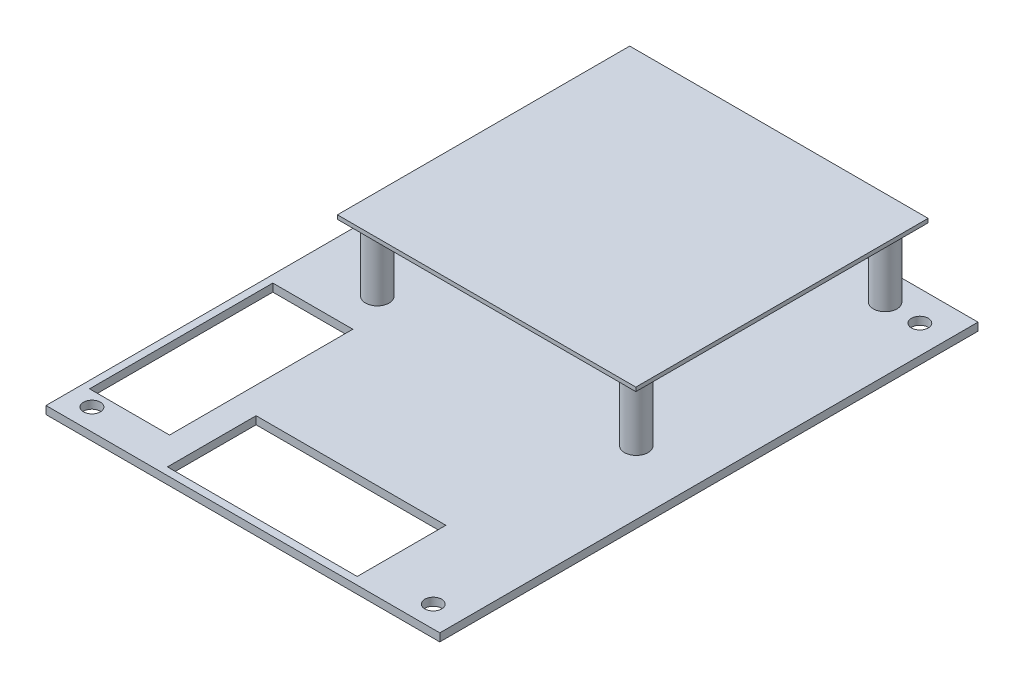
from build123d import *

# Parameters (mm, degrees)
SKETCH1_W             = 76.2
SKETCH1_H             = 104.14
BOSS_EXTRUDE1_DEPTH   = 1.524
F_4_CLEARANCE_HOLE1_D = 3.2639
SKETCH4_R             = 2.286
BOSS_EXTRUDE2_DEPTH   = 12.7
SKETCH5_W             = 57.740663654
SKETCH5_H             = 56.557453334
BOSS_EXTRUDE3_DEPTH   = 0.762
SKETCH7_W             = 15.478981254
SKETCH7_H             = 35.459502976
SKETCH7_W_2           = 36.723093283
SKETCH7_H_2           = 17.15423125
CUT_EXTRUDE1_DEPTH    = 67.238018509


with BuildPart() as part:
    # Sketch1 → Boss-Extrude1 (new body)
    with BuildSketch(Plane(origin=(0, 0, 0), x_dir=(1, 0, 0), z_dir=(0, 1, 0))):
        Rectangle(SKETCH1_W, SKETCH1_H)
    extrude(amount=BOSS_EXTRUDE1_DEPTH)

    # 4 Clearance Hole1 (through all)
    with Locations(Plane(origin=(0, 1.524, 0), x_dir=(1, 0, 0), z_dir=(0, 1, 0))):
        with Locations((-33.401, 46.2788), (32.639, 46.2788), (-33.401, -47.879), (32.639, -47.879)):
            Hole(F_4_CLEARANCE_HOLE1_D / 2)

    # Sketch4 → Boss-Extrude2 (add)
    with BuildSketch(Plane(origin=(0, 1.524, 0), x_dir=(1, 0, 0), z_dir=(0, 1, 0))):
        with Locations(Location((-24.346324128, 46.441005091, 0), (0, 0, 270))):
            Circle(SKETCH4_R)
        with Locations(Location((25.764556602, 46.441005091, 0), (0, 0, 270))):
            Circle(SKETCH4_R)
        with Locations(Location((-24.346324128, -1.713697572, 0), (0, 0, 270))):
            Circle(SKETCH4_R)
        with Locations(Location((25.764556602, -1.713697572, 0), (0, 0, 270))):
            Circle(SKETCH4_R)
    extrude(amount=BOSS_EXTRUDE2_DEPTH)

    # Sketch5 → Boss-Extrude3 (add)
    with BuildSketch(Plane(origin=(0, 14.224, 0), x_dir=(1, 0, 0), z_dir=(0, 1, 0))):
        with Locations((0.473284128, 22.895119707)):
            Rectangle(SKETCH5_W, SKETCH5_H)
    extrude(amount=BOSS_EXTRUDE3_DEPTH)

    # Sketch7 → Cut-Extrude1 (cut, through all)
    with BuildSketch(Plane.XZ):
        with Locations((-28.935688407, 27.336578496)):
            Rectangle(SKETCH7_W, SKETCH7_H)
        with Locations((2.298684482, 42.034209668)):
            Rectangle(SKETCH7_W_2, SKETCH7_H_2)
    extrude(amount=-CUT_EXTRUDE1_DEPTH, mode=Mode.SUBTRACT)


solid = part.part
